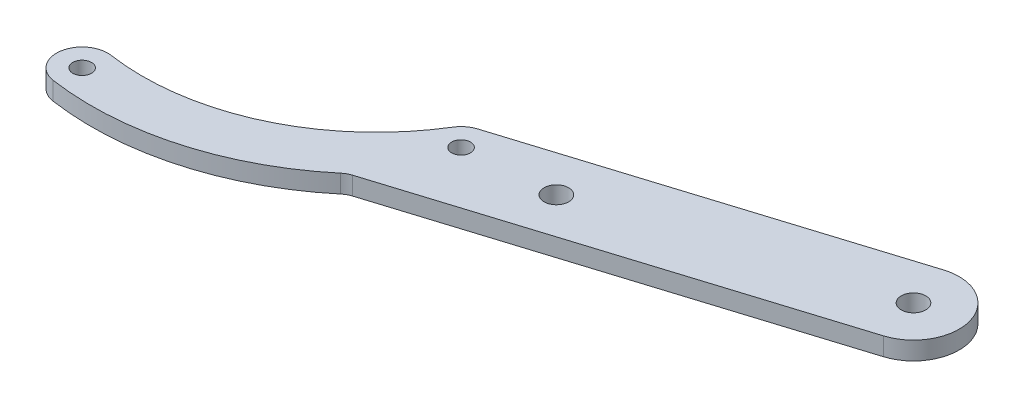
from build123d import *

# Parameters (mm, degrees)
SKETCH1_R             = 1
BOSS_EXTRUDE1_DEPTH   = 3.175
M4X0_7_TAPPED_HOLE1_D = 3.3
M4_CLEARANCE_HOLE1_D  = 4.3
FILLET1_RADIUS        = 8
FILLET1_LENGTH        = 3.175


with BuildPart() as part:
    # Sketch1 → Boss-Extrude1 (new body)
    with BuildSketch(Plane(origin=(0, 0, 0), x_dir=(1, 0, 0), z_dir=(0, 1, 0))):
        with BuildLine():
            Line((-19.756977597, 2.214009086), (-14.989814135, -13.059305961))
            Line((-14.989814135, -13.059305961), (-93.569013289, -37.585735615))
            ThreePointArc((-93.569013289, -37.585735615), (-94.293133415, -37.892756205), (-94.943178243, -38.335535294))
            ThreePointArc((-94.943178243, -38.335535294), (-113.40931882, -48.08894335), (-134.248974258, -49.443962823))
            ThreePointArc((-134.248974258, -49.443962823), (-138.037011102, -44.354378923), (-132.947427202, -40.566342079))
            ThreePointArc((-132.947427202, -40.566342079), (-109.672651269, -37.158619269), (-92.101446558, -21.5195485))
            ThreePointArc((-92.101446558, -21.5195485), (-91.034794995, -20.331199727), (-89.619482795, -19.591733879))
            Line((-89.619482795, -19.591733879), (-19.756977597, 2.214009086))
        make_face()
        with Locations(Location((-88.282811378, -23.874239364, 0), (0, 0, 270))):
            Circle(SKETCH1_R, mode=Mode.SUBTRACT)
        with Locations(Location((-133.59820073, -45.005152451, 0), (0, 0, 270))):
            Circle(SKETCH1_R, mode=Mode.SUBTRACT)
    extrude(amount=BOSS_EXTRUDE1_DEPTH)

    # M4x0.7 Tapped Hole1 (through all)
    with Locations(Plane(origin=(0, 3.175, 0), x_dir=(1, 0, 0), z_dir=(0, 1, 0))):
        with Locations((-133.59820073, -45.005152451), (-88.282811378, -23.874239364)):
            Hole(M4X0_7_TAPPED_HOLE1_D / 2)

    # M4 Clearance Hole1 (through all)
    with Locations(Plane(origin=(0, 0, 0), x_dir=(-1, 0, 0), z_dir=(0, -1, 0))):
        with Locations((25.01005339, -7.806230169), (72.739162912, -22.703615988)):
            Hole(M4_CLEARANCE_HOLE1_D / 2)

    # Fillet1: full round fillet: the end face becomes a half cylinder, R = half its width
    fillet1_face = Plane((-17.373395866, 1.5875, 5.422648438), x_dir=(0, 1, 0), z_dir=(0.954582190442, 0, -0.297947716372))  # on the end face: x along it, z out of the body
    fillet1_slab = fillet1_face.offset(-FILLET1_RADIUS / 2) * Box(FILLET1_LENGTH, 2 * FILLET1_RADIUS, FILLET1_RADIUS, mode=Mode.PRIVATE)  # the body's end, R deep
    fillet1_round = Plane((-25.01005339, 1.5875, 7.806230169), x_dir=(0.954582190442, 0, -0.297947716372), z_dir=(0, 1, 0)) * Cylinder(FILLET1_RADIUS, FILLET1_LENGTH, mode=Mode.PRIVATE)  # its axis R under the face
    add(fillet1_slab - fillet1_round, mode=Mode.SUBTRACT)


solid = part.part
